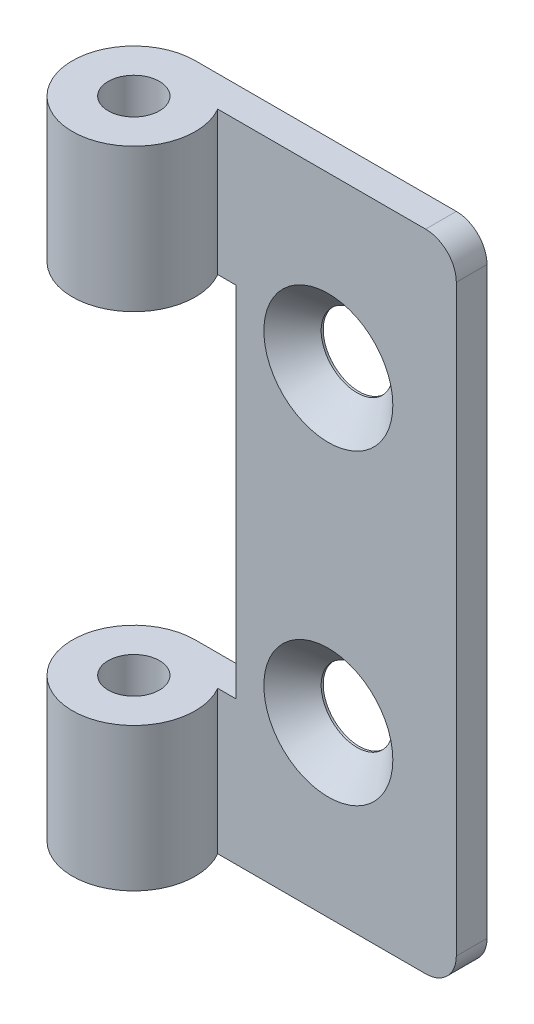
ISO-10303-21;
HEADER;
FILE_DESCRIPTION(('STEP AP214'),'2;1');
FILE_NAME('part.step','',(''),(''),'','','');
FILE_SCHEMA(('AUTOMOTIVE_DESIGN { 1 0 10303 214 1 1 1 1 }'));
ENDSEC;
DATA;
#1=APPLICATION_CONTEXT('core data for automotive mechanical design processes');
#2=APPLICATION_PROTOCOL_DEFINITION('international standard','automotive_design',2000,#1);
#3=PRODUCT_CONTEXT('',#1,'mechanical');
#4=PRODUCT('Part','Part','',(#3));
#5=PRODUCT_RELATED_PRODUCT_CATEGORY('part','',(#4));
#6=PRODUCT_DEFINITION_FORMATION('','',#4);
#7=PRODUCT_DEFINITION_CONTEXT('part definition',#1,'design');
#8=PRODUCT_DEFINITION('design','',#6,#7);
#9=PRODUCT_DEFINITION_SHAPE('','',#8);
#10=(LENGTH_UNIT() NAMED_UNIT(*) SI_UNIT(.MILLI.,.METRE.));
#11=(NAMED_UNIT(*) PLANE_ANGLE_UNIT() SI_UNIT($,.RADIAN.));
#12=(NAMED_UNIT(*) SI_UNIT($,.STERADIAN.) SOLID_ANGLE_UNIT());
#13=UNCERTAINTY_MEASURE_WITH_UNIT(LENGTH_MEASURE(1.E-05),#10,'distance_accuracy_value','');
#14=(GEOMETRIC_REPRESENTATION_CONTEXT(3) GLOBAL_UNCERTAINTY_ASSIGNED_CONTEXT((#13)) GLOBAL_UNIT_ASSIGNED_CONTEXT((#10,
#11,#12)) REPRESENTATION_CONTEXT('',''));
#15=CARTESIAN_POINT('',(0.,0.,0.));
#16=DIRECTION('',(0.,0.,1.));
#17=DIRECTION('',(1.,0.,0.));
#18=AXIS2_PLACEMENT_3D('',#15,#16,#17);
#19=CARTESIAN_POINT('',(0.,31.5,0.));
#20=DIRECTION('',(0.,-1.,0.));
#21=DIRECTION('',(0.,0.,-1.));
#22=AXIS2_PLACEMENT_3D('',#19,#20,#21);
#23=CYLINDRICAL_SURFACE('',#22,6.);
#24=CARTESIAN_POINT('',(0.,17.5,0.));
#25=DIRECTION('',(0.,1.,0.));
#26=DIRECTION('',(-1.,0.,0.));
#27=AXIS2_PLACEMENT_3D('',#24,#25,#26);
#28=CIRCLE('',#27,6.);
#29=CARTESIAN_POINT('',(0.,17.5,-6.));
#30=VERTEX_POINT('',#29);
#31=CARTESIAN_POINT('',(5.19615242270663,17.5,-3.));
#32=VERTEX_POINT('',#31);
#33=EDGE_CURVE('E134',#30,#32,#28,.T.);
#34=ORIENTED_EDGE('',*,*,#33,.T.);
#35=DIRECTION('',(0.,-1.,0.));
#36=VECTOR('',#35,1.);
#37=CARTESIAN_POINT('',(5.19615242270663,31.5,-3.));
#38=LINE('',#37,#36);
#39=CARTESIAN_POINT('',(5.19615242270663,31.5,-3.));
#40=VERTEX_POINT('',#39);
#41=EDGE_CURVE('E139',#40,#32,#38,.T.);
#42=ORIENTED_EDGE('',*,*,#41,.F.);
#43=CARTESIAN_POINT('',(0.,31.5,0.));
#44=DIRECTION('',(0.,1.,0.));
#45=DIRECTION('',(0.,0.,1.));
#46=AXIS2_PLACEMENT_3D('',#43,#44,#45);
#47=CIRCLE('',#46,6.);
#48=CARTESIAN_POINT('',(0.,31.5,-6.));
#49=VERTEX_POINT('',#48);
#50=EDGE_CURVE('E164',#49,#40,#47,.T.);
#51=ORIENTED_EDGE('',*,*,#50,.F.);
#52=DIRECTION('',(0.,-1.,0.));
#53=VECTOR('',#52,1.);
#54=CARTESIAN_POINT('',(0.,31.5,-6.));
#55=LINE('',#54,#53);
#56=EDGE_CURVE('E178',#49,#30,#55,.T.);
#57=ORIENTED_EDGE('',*,*,#56,.T.);
#58=EDGE_LOOP('',(#34,#42,#51,#57));
#59=FACE_BOUND('',#58,.T.);
#60=ADVANCED_FACE('F35',(#59),#23,.T.);
#61=CARTESIAN_POINT('',(0.,-17.5,0.));
#62=DIRECTION('',(0.,-1.,0.));
#63=DIRECTION('',(1.,0.,0.));
#64=AXIS2_PLACEMENT_3D('',#61,#62,#63);
#65=CIRCLE('',#64,6.);
#66=CARTESIAN_POINT('',(5.19615242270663,-17.5,-3.));
#67=VERTEX_POINT('',#66);
#68=CARTESIAN_POINT('',(0.,-17.5,-6.));
#69=VERTEX_POINT('',#68);
#70=EDGE_CURVE('E161',#67,#69,#65,.T.);
#71=ORIENTED_EDGE('',*,*,#70,.T.);
#72=CARTESIAN_POINT('',(0.,-31.5,-6.));
#73=VERTEX_POINT('',#72);
#74=EDGE_CURVE('E172',#69,#73,#55,.T.);
#75=ORIENTED_EDGE('',*,*,#74,.T.);
#76=CARTESIAN_POINT('',(0.,-31.5,0.));
#77=DIRECTION('',(0.,1.,0.));
#78=DIRECTION('',(0.,0.,1.));
#79=AXIS2_PLACEMENT_3D('',#76,#77,#78);
#80=CIRCLE('',#79,6.);
#81=CARTESIAN_POINT('',(5.19615242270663,-31.5,-3.));
#82=VERTEX_POINT('',#81);
#83=EDGE_CURVE('E163',#73,#82,#80,.T.);
#84=ORIENTED_EDGE('',*,*,#83,.T.);
#85=EDGE_CURVE('E185',#67,#82,#38,.T.);
#86=ORIENTED_EDGE('',*,*,#85,.F.);
#87=EDGE_LOOP('',(#71,#75,#84,#86));
#88=FACE_BOUND('',#87,.T.);
#89=ADVANCED_FACE('F212',(#88),#23,.T.);
#90=CARTESIAN_POINT('',(5.19615242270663,31.5,-3.));
#91=DIRECTION('',(0.,0.,-1.));
#92=DIRECTION('',(-1.,0.,0.));
#93=AXIS2_PLACEMENT_3D('',#90,#91,#92);
#94=PLANE('',#93);
#95=CARTESIAN_POINT('',(16.,15.,-3.));
#96=DIRECTION('',(0.,0.,1.));
#97=DIRECTION('',(1.,0.,0.));
#98=AXIS2_PLACEMENT_3D('',#95,#96,#97);
#99=CIRCLE('',#98,6.3);
#100=CARTESIAN_POINT('',(22.3,15.,-3.));
#101=VERTEX_POINT('',#100);
#102=EDGE_CURVE('E286',#101,#101,#99,.T.);
#103=ORIENTED_EDGE('',*,*,#102,.F.);
#104=EDGE_LOOP('',(#103));
#105=FACE_BOUND('',#104,.T.);
#106=CARTESIAN_POINT('',(16.,-15.,-3.));
#107=DIRECTION('',(0.,0.,1.));
#108=DIRECTION('',(1.,0.,0.));
#109=AXIS2_PLACEMENT_3D('',#106,#107,#108);
#110=CIRCLE('',#109,6.3);
#111=CARTESIAN_POINT('',(22.3,-15.,-3.));
#112=VERTEX_POINT('',#111);
#113=EDGE_CURVE('E301',#112,#112,#110,.T.);
#114=ORIENTED_EDGE('',*,*,#113,.F.);
#115=EDGE_LOOP('',(#114));
#116=FACE_BOUND('',#115,.T.);
#117=DIRECTION('',(1.,0.,0.));
#118=VECTOR('',#117,1.);
#119=CARTESIAN_POINT('',(5.19615242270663,-31.5,-3.));
#120=LINE('',#119,#118);
#121=CARTESIAN_POINT('',(25.5,-31.5,-3.));
#122=VERTEX_POINT('',#121);
#123=EDGE_CURVE('E175',#82,#122,#120,.T.);
#124=ORIENTED_EDGE('',*,*,#123,.T.);
#125=CARTESIAN_POINT('',(25.5,-28.5,-3.));
#126=DIRECTION('',(0.,0.,-1.));
#127=DIRECTION('',(-1.,0.,0.));
#128=AXIS2_PLACEMENT_3D('',#125,#126,#127);
#129=CIRCLE('',#128,3.);
#130=CARTESIAN_POINT('',(28.5,-28.5,-3.));
#131=VERTEX_POINT('',#130);
#132=EDGE_CURVE('E44',#122,#131,#129,.F.);
#133=ORIENTED_EDGE('',*,*,#132,.T.);
#134=DIRECTION('',(0.,-1.,0.));
#135=VECTOR('',#134,1.);
#136=CARTESIAN_POINT('',(28.5,31.5,-3.));
#137=LINE('',#136,#135);
#138=CARTESIAN_POINT('',(28.5,28.5,-3.));
#139=VERTEX_POINT('',#138);
#140=EDGE_CURVE('E182',#139,#131,#137,.T.);
#141=ORIENTED_EDGE('',*,*,#140,.F.);
#142=CARTESIAN_POINT('',(25.5,28.5,-3.));
#143=DIRECTION('',(0.,0.,-1.));
#144=DIRECTION('',(-1.,0.,0.));
#145=AXIS2_PLACEMENT_3D('',#142,#143,#144);
#146=CIRCLE('',#145,3.);
#147=CARTESIAN_POINT('',(25.5,31.5,-3.));
#148=VERTEX_POINT('',#147);
#149=EDGE_CURVE('E51',#139,#148,#146,.F.);
#150=ORIENTED_EDGE('',*,*,#149,.T.);
#151=DIRECTION('',(1.,0.,0.));
#152=VECTOR('',#151,1.);
#153=CARTESIAN_POINT('',(5.19615242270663,31.5,-3.));
#154=LINE('',#153,#152);
#155=EDGE_CURVE('E167',#40,#148,#154,.T.);
#156=ORIENTED_EDGE('',*,*,#155,.F.);
#157=ORIENTED_EDGE('',*,*,#41,.T.);
#158=DIRECTION('',(1.,0.,0.));
#159=VECTOR('',#158,1.);
#160=CARTESIAN_POINT('',(5.19615242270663,17.5,-3.));
#161=LINE('',#160,#159);
#162=CARTESIAN_POINT('',(7.,17.5,-3.));
#163=VERTEX_POINT('',#162);
#164=EDGE_CURVE('E153',#32,#163,#161,.T.);
#165=ORIENTED_EDGE('',*,*,#164,.T.);
#166=DIRECTION('',(0.,-1.,0.));
#167=VECTOR('',#166,1.);
#168=CARTESIAN_POINT('',(7.,31.5,-3.));
#169=LINE('',#168,#167);
#170=CARTESIAN_POINT('',(7.,-17.5,-3.));
#171=VERTEX_POINT('',#170);
#172=EDGE_CURVE('E124',#163,#171,#169,.T.);
#173=ORIENTED_EDGE('',*,*,#172,.T.);
#174=DIRECTION('',(-1.,0.,0.));
#175=VECTOR('',#174,1.);
#176=CARTESIAN_POINT('',(5.19615242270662,-17.5,-3.));
#177=LINE('',#176,#175);
#178=EDGE_CURVE('E158',#171,#67,#177,.T.);
#179=ORIENTED_EDGE('',*,*,#178,.T.);
#180=ORIENTED_EDGE('',*,*,#85,.T.);
#181=EDGE_LOOP('',(#124,#133,#141,#150,#156,#157,#165,#173,#179,#180));
#182=FACE_BOUND('',#181,.T.);
#183=ADVANCED_FACE('F199',(#105,#116,#182),#94,.F.);
#184=CARTESIAN_POINT('',(28.5,31.5,-6.));
#185=DIRECTION('',(-1.,0.,0.));
#186=DIRECTION('',(0.,0.,1.));
#187=AXIS2_PLACEMENT_3D('',#184,#185,#186);
#188=PLANE('',#187);
#189=ORIENTED_EDGE('',*,*,#140,.T.);
#190=DIRECTION('',(0.,0.,-1.));
#191=VECTOR('',#190,1.);
#192=CARTESIAN_POINT('',(28.5,-28.5,-6.));
#193=LINE('',#192,#191);
#194=CARTESIAN_POINT('',(28.5,-28.5,-6.));
#195=VERTEX_POINT('',#194);
#196=EDGE_CURVE('E189',#131,#195,#193,.T.);
#197=ORIENTED_EDGE('',*,*,#196,.T.);
#198=DIRECTION('',(0.,-1.,0.));
#199=VECTOR('',#198,1.);
#200=CARTESIAN_POINT('',(28.5,31.5,-6.));
#201=LINE('',#200,#199);
#202=CARTESIAN_POINT('',(28.5,28.5,-6.));
#203=VERTEX_POINT('',#202);
#204=EDGE_CURVE('E180',#203,#195,#201,.T.);
#205=ORIENTED_EDGE('',*,*,#204,.F.);
#206=DIRECTION('',(0.,0.,-1.));
#207=VECTOR('',#206,1.);
#208=CARTESIAN_POINT('',(28.5,28.5,-3.));
#209=LINE('',#208,#207);
#210=EDGE_CURVE('E138',#203,#139,#209,.F.);
#211=ORIENTED_EDGE('',*,*,#210,.T.);
#212=EDGE_LOOP('',(#189,#197,#205,#211));
#213=FACE_BOUND('',#212,.T.);
#214=ADVANCED_FACE('F203',(#213),#188,.F.);
#215=CARTESIAN_POINT('',(0.,31.5,-6.));
#216=DIRECTION('',(0.,0.,1.));
#217=DIRECTION('',(1.,0.,0.));
#218=AXIS2_PLACEMENT_3D('',#215,#216,#217);
#219=PLANE('',#218);
#220=CARTESIAN_POINT('',(16.,15.,-6.));
#221=DIRECTION('',(0.,0.,1.));
#222=DIRECTION('',(1.,0.,0.));
#223=AXIS2_PLACEMENT_3D('',#220,#221,#222);
#224=CIRCLE('',#223,3.5);
#225=CARTESIAN_POINT('',(19.5,15.,-6.));
#226=VERTEX_POINT('',#225);
#227=EDGE_CURVE('E298',#226,#226,#224,.T.);
#228=ORIENTED_EDGE('',*,*,#227,.T.);
#229=EDGE_LOOP('',(#228));
#230=FACE_BOUND('',#229,.T.);
#231=CARTESIAN_POINT('',(16.,-15.,-6.));
#232=DIRECTION('',(0.,0.,1.));
#233=DIRECTION('',(1.,0.,0.));
#234=AXIS2_PLACEMENT_3D('',#231,#232,#233);
#235=CIRCLE('',#234,3.5);
#236=CARTESIAN_POINT('',(19.5,-15.,-6.));
#237=VERTEX_POINT('',#236);
#238=EDGE_CURVE('E145',#237,#237,#235,.T.);
#239=ORIENTED_EDGE('',*,*,#238,.T.);
#240=EDGE_LOOP('',(#239));
#241=FACE_BOUND('',#240,.T.);
#242=ORIENTED_EDGE('',*,*,#204,.T.);
#243=CARTESIAN_POINT('',(25.5,-28.5,-6.));
#244=DIRECTION('',(0.,0.,1.));
#245=DIRECTION('',(1.,0.,0.));
#246=AXIS2_PLACEMENT_3D('',#243,#244,#245);
#247=CIRCLE('',#246,3.);
#248=CARTESIAN_POINT('',(25.5,-31.5,-6.));
#249=VERTEX_POINT('',#248);
#250=EDGE_CURVE('E194',#195,#249,#247,.F.);
#251=ORIENTED_EDGE('',*,*,#250,.T.);
#252=DIRECTION('',(-1.,0.,0.));
#253=VECTOR('',#252,1.);
#254=CARTESIAN_POINT('',(0.,-31.5,-6.));
#255=LINE('',#254,#253);
#256=EDGE_CURVE('E168',#249,#73,#255,.T.);
#257=ORIENTED_EDGE('',*,*,#256,.T.);
#258=ORIENTED_EDGE('',*,*,#74,.F.);
#259=DIRECTION('',(-1.,0.,0.));
#260=VECTOR('',#259,1.);
#261=CARTESIAN_POINT('',(-11.0013384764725,-17.5,-6.));
#262=LINE('',#261,#260);
#263=CARTESIAN_POINT('',(7.,-17.5,-6.));
#264=VERTEX_POINT('',#263);
#265=EDGE_CURVE('E129',#264,#69,#262,.T.);
#266=ORIENTED_EDGE('',*,*,#265,.F.);
#267=DIRECTION('',(0.,-1.,0.));
#268=VECTOR('',#267,1.);
#269=CARTESIAN_POINT('',(7.,17.5,-6.));
#270=LINE('',#269,#268);
#271=CARTESIAN_POINT('',(7.,17.5,-6.));
#272=VERTEX_POINT('',#271);
#273=EDGE_CURVE('E121',#272,#264,#270,.T.);
#274=ORIENTED_EDGE('',*,*,#273,.F.);
#275=DIRECTION('',(-1.,0.,0.));
#276=VECTOR('',#275,1.);
#277=CARTESIAN_POINT('',(0.,17.5,-6.));
#278=LINE('',#277,#276);
#279=EDGE_CURVE('E132',#272,#30,#278,.T.);
#280=ORIENTED_EDGE('',*,*,#279,.T.);
#281=ORIENTED_EDGE('',*,*,#56,.F.);
#282=DIRECTION('',(-1.,0.,0.));
#283=VECTOR('',#282,1.);
#284=CARTESIAN_POINT('',(0.,31.5,-6.));
#285=LINE('',#284,#283);
#286=CARTESIAN_POINT('',(25.5,31.5,-6.));
#287=VERTEX_POINT('',#286);
#288=EDGE_CURVE('E170',#287,#49,#285,.T.);
#289=ORIENTED_EDGE('',*,*,#288,.F.);
#290=CARTESIAN_POINT('',(25.5,28.5,-6.));
#291=DIRECTION('',(0.,0.,1.));
#292=DIRECTION('',(1.,0.,0.));
#293=AXIS2_PLACEMENT_3D('',#290,#291,#292);
#294=CIRCLE('',#293,3.);
#295=EDGE_CURVE('E192',#287,#203,#294,.F.);
#296=ORIENTED_EDGE('',*,*,#295,.T.);
#297=EDGE_LOOP('',(#242,#251,#257,#258,#266,#274,#280,#281,#289,#296));
#298=FACE_BOUND('',#297,.T.);
#299=ADVANCED_FACE('F142',(#230,#241,#298),#219,.F.);
#300=CARTESIAN_POINT('',(0.,31.5,0.));
#301=DIRECTION('',(0.,1.,0.));
#302=DIRECTION('',(0.,0.,1.));
#303=AXIS2_PLACEMENT_3D('',#300,#301,#302);
#304=PLANE('',#303);
#305=CARTESIAN_POINT('',(0.,31.5,0.));
#306=DIRECTION('',(0.,1.,0.));
#307=DIRECTION('',(0.,0.,1.));
#308=AXIS2_PLACEMENT_3D('',#305,#306,#307);
#309=CIRCLE('',#308,2.5);
#310=CARTESIAN_POINT('',(0.,31.5,2.5));
#311=VERTEX_POINT('',#310);
#312=EDGE_CURVE('E293',#311,#311,#309,.T.);
#313=ORIENTED_EDGE('',*,*,#312,.F.);
#314=EDGE_LOOP('',(#313));
#315=FACE_BOUND('',#314,.T.);
#316=ORIENTED_EDGE('',*,*,#155,.T.);
#317=DIRECTION('',(0.,0.,-1.));
#318=VECTOR('',#317,1.);
#319=CARTESIAN_POINT('',(25.5,31.5,-6.));
#320=LINE('',#319,#318);
#321=EDGE_CURVE('E11',#148,#287,#320,.T.);
#322=ORIENTED_EDGE('',*,*,#321,.T.);
#323=ORIENTED_EDGE('',*,*,#288,.T.);
#324=ORIENTED_EDGE('',*,*,#50,.T.);
#325=EDGE_LOOP('',(#316,#322,#323,#324));
#326=FACE_BOUND('',#325,.T.);
#327=ADVANCED_FACE('F220',(#315,#326),#304,.T.);
#328=CARTESIAN_POINT('',(0.,-31.5,0.));
#329=DIRECTION('',(0.,1.,0.));
#330=DIRECTION('',(0.,0.,1.));
#331=AXIS2_PLACEMENT_3D('',#328,#329,#330);
#332=PLANE('',#331);
#333=CARTESIAN_POINT('',(0.,-31.5,0.));
#334=DIRECTION('',(0.,1.,0.));
#335=DIRECTION('',(0.,0.,1.));
#336=AXIS2_PLACEMENT_3D('',#333,#334,#335);
#337=CIRCLE('',#336,2.5);
#338=CARTESIAN_POINT('',(0.,-31.5,2.5));
#339=VERTEX_POINT('',#338);
#340=EDGE_CURVE('E282',#339,#339,#337,.T.);
#341=ORIENTED_EDGE('',*,*,#340,.T.);
#342=EDGE_LOOP('',(#341));
#343=FACE_BOUND('',#342,.T.);
#344=ORIENTED_EDGE('',*,*,#256,.F.);
#345=DIRECTION('',(0.,0.,-1.));
#346=VECTOR('',#345,1.);
#347=CARTESIAN_POINT('',(25.5,-31.5,0.));
#348=LINE('',#347,#346);
#349=EDGE_CURVE('E59',#249,#122,#348,.F.);
#350=ORIENTED_EDGE('',*,*,#349,.T.);
#351=ORIENTED_EDGE('',*,*,#123,.F.);
#352=ORIENTED_EDGE('',*,*,#83,.F.);
#353=EDGE_LOOP('',(#344,#350,#351,#352));
#354=FACE_BOUND('',#353,.T.);
#355=ADVANCED_FACE('F209',(#343,#354),#332,.F.);
#356=CARTESIAN_POINT('',(-11.0013384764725,-17.5,6.));
#357=DIRECTION('',(0.,-1.,0.));
#358=DIRECTION('',(1.,0.,0.));
#359=AXIS2_PLACEMENT_3D('',#356,#357,#358);
#360=PLANE('',#359);
#361=CARTESIAN_POINT('',(0.,-17.5,0.));
#362=DIRECTION('',(0.,-1.,0.));
#363=DIRECTION('',(1.,0.,0.));
#364=AXIS2_PLACEMENT_3D('',#361,#362,#363);
#365=CIRCLE('',#364,2.5);
#366=CARTESIAN_POINT('',(2.5,-17.5,0.));
#367=VERTEX_POINT('',#366);
#368=EDGE_CURVE('E285',#367,#367,#365,.T.);
#369=ORIENTED_EDGE('',*,*,#368,.T.);
#370=EDGE_LOOP('',(#369));
#371=FACE_BOUND('',#370,.T.);
#372=ORIENTED_EDGE('',*,*,#70,.F.);
#373=ORIENTED_EDGE('',*,*,#178,.F.);
#374=DIRECTION('',(0.,0.,-1.));
#375=VECTOR('',#374,1.);
#376=CARTESIAN_POINT('',(7.,-17.5,6.));
#377=LINE('',#376,#375);
#378=EDGE_CURVE('E128',#171,#264,#377,.T.);
#379=ORIENTED_EDGE('',*,*,#378,.T.);
#380=ORIENTED_EDGE('',*,*,#265,.T.);
#381=EDGE_LOOP('',(#372,#373,#379,#380));
#382=FACE_BOUND('',#381,.T.);
#383=ADVANCED_FACE('F214',(#371,#382),#360,.F.);
#384=CARTESIAN_POINT('',(7.,17.5,6.));
#385=DIRECTION('',(1.,0.,0.));
#386=DIRECTION('',(0.,1.,0.));
#387=AXIS2_PLACEMENT_3D('',#384,#385,#386);
#388=PLANE('',#387);
#389=DIRECTION('',(0.,0.,-1.));
#390=VECTOR('',#389,1.);
#391=CARTESIAN_POINT('',(7.,17.5,6.));
#392=LINE('',#391,#390);
#393=EDGE_CURVE('E116',#163,#272,#392,.T.);
#394=ORIENTED_EDGE('',*,*,#393,.T.);
#395=ORIENTED_EDGE('',*,*,#273,.T.);
#396=ORIENTED_EDGE('',*,*,#378,.F.);
#397=ORIENTED_EDGE('',*,*,#172,.F.);
#398=EDGE_LOOP('',(#394,#395,#396,#397));
#399=FACE_BOUND('',#398,.T.);
#400=ADVANCED_FACE('F118',(#399),#388,.F.);
#401=CARTESIAN_POINT('',(-11.0013384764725,17.5,6.));
#402=DIRECTION('',(0.,1.,0.));
#403=DIRECTION('',(-1.,0.,0.));
#404=AXIS2_PLACEMENT_3D('',#401,#402,#403);
#405=PLANE('',#404);
#406=CARTESIAN_POINT('',(0.,17.5,0.));
#407=DIRECTION('',(0.,1.,0.));
#408=DIRECTION('',(-1.,0.,0.));
#409=AXIS2_PLACEMENT_3D('',#406,#407,#408);
#410=CIRCLE('',#409,2.5);
#411=CARTESIAN_POINT('',(-2.5,17.5,0.));
#412=VERTEX_POINT('',#411);
#413=EDGE_CURVE('E39',#412,#412,#410,.T.);
#414=ORIENTED_EDGE('',*,*,#413,.T.);
#415=EDGE_LOOP('',(#414));
#416=FACE_BOUND('',#415,.T.);
#417=ORIENTED_EDGE('',*,*,#279,.F.);
#418=ORIENTED_EDGE('',*,*,#393,.F.);
#419=ORIENTED_EDGE('',*,*,#164,.F.);
#420=ORIENTED_EDGE('',*,*,#33,.F.);
#421=EDGE_LOOP('',(#417,#418,#419,#420));
#422=FACE_BOUND('',#421,.T.);
#423=ADVANCED_FACE('F133',(#416,#422),#405,.F.);
#424=CARTESIAN_POINT('',(25.5,-28.5,-6.));
#425=DIRECTION('',(0.,0.,-1.));
#426=DIRECTION('',(-1.,0.,0.));
#427=AXIS2_PLACEMENT_3D('',#424,#425,#426);
#428=CYLINDRICAL_SURFACE('',#427,3.);
#429=ORIENTED_EDGE('',*,*,#132,.F.);
#430=ORIENTED_EDGE('',*,*,#349,.F.);
#431=ORIENTED_EDGE('',*,*,#250,.F.);
#432=ORIENTED_EDGE('',*,*,#196,.F.);
#433=EDGE_LOOP('',(#429,#430,#431,#432));
#434=FACE_BOUND('',#433,.T.);
#435=ADVANCED_FACE('F206',(#434),#428,.T.);
#436=CARTESIAN_POINT('',(25.5,28.5,0.));
#437=DIRECTION('',(0.,0.,1.));
#438=DIRECTION('',(1.,0.,0.));
#439=AXIS2_PLACEMENT_3D('',#436,#437,#438);
#440=CYLINDRICAL_SURFACE('',#439,3.);
#441=ORIENTED_EDGE('',*,*,#149,.F.);
#442=ORIENTED_EDGE('',*,*,#210,.F.);
#443=ORIENTED_EDGE('',*,*,#295,.F.);
#444=ORIENTED_EDGE('',*,*,#321,.F.);
#445=EDGE_LOOP('',(#441,#442,#443,#444));
#446=FACE_BOUND('',#445,.T.);
#447=ADVANCED_FACE('F37',(#446),#440,.T.);
#448=CARTESIAN_POINT('',(16.,-15.,-3.));
#449=DIRECTION('',(0.,0.,1.));
#450=DIRECTION('',(1.,0.,0.));
#451=AXIS2_PLACEMENT_3D('',#448,#449,#450);
#452=CYLINDRICAL_SURFACE('',#451,3.5);
#453=ORIENTED_EDGE('',*,*,#238,.F.);
#454=EDGE_LOOP('',(#453));
#455=FACE_BOUND('',#454,.T.);
#456=CARTESIAN_POINT('',(16.,-15.,-5.8));
#457=DIRECTION('',(0.,0.,1.));
#458=DIRECTION('',(1.,0.,0.));
#459=AXIS2_PLACEMENT_3D('',#456,#457,#458);
#460=CIRCLE('',#459,3.5);
#461=CARTESIAN_POINT('',(19.5,-15.,-5.8));
#462=VERTEX_POINT('',#461);
#463=EDGE_CURVE('E149',#462,#462,#460,.T.);
#464=ORIENTED_EDGE('',*,*,#463,.T.);
#465=EDGE_LOOP('',(#464));
#466=FACE_BOUND('',#465,.T.);
#467=ADVANCED_FACE('F224',(#455,#466),#452,.F.);
#468=CARTESIAN_POINT('',(16.,-15.,-3.));
#469=DIRECTION('',(0.,0.,1.));
#470=DIRECTION('',(1.,0.,0.));
#471=AXIS2_PLACEMENT_3D('',#468,#469,#470);
#472=CONICAL_SURFACE('',#471,6.3,0.785398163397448);
#473=ORIENTED_EDGE('',*,*,#463,.F.);
#474=EDGE_LOOP('',(#473));
#475=FACE_BOUND('',#474,.T.);
#476=ORIENTED_EDGE('',*,*,#113,.T.);
#477=EDGE_LOOP('',(#476));
#478=FACE_BOUND('',#477,.T.);
#479=ADVANCED_FACE('F229',(#475,#478),#472,.F.);
#480=CARTESIAN_POINT('',(16.,15.,-3.));
#481=DIRECTION('',(0.,0.,1.));
#482=DIRECTION('',(1.,0.,0.));
#483=AXIS2_PLACEMENT_3D('',#480,#481,#482);
#484=CYLINDRICAL_SURFACE('',#483,3.5);
#485=ORIENTED_EDGE('',*,*,#227,.F.);
#486=EDGE_LOOP('',(#485));
#487=FACE_BOUND('',#486,.T.);
#488=CARTESIAN_POINT('',(16.,15.,-5.8));
#489=DIRECTION('',(0.,0.,1.));
#490=DIRECTION('',(1.,0.,0.));
#491=AXIS2_PLACEMENT_3D('',#488,#489,#490);
#492=CIRCLE('',#491,3.5);
#493=CARTESIAN_POINT('',(19.5,15.,-5.8));
#494=VERTEX_POINT('',#493);
#495=EDGE_CURVE('E289',#494,#494,#492,.T.);
#496=ORIENTED_EDGE('',*,*,#495,.T.);
#497=EDGE_LOOP('',(#496));
#498=FACE_BOUND('',#497,.T.);
#499=ADVANCED_FACE('F262',(#487,#498),#484,.F.);
#500=CARTESIAN_POINT('',(16.,15.,-3.));
#501=DIRECTION('',(0.,0.,1.));
#502=DIRECTION('',(1.,0.,0.));
#503=AXIS2_PLACEMENT_3D('',#500,#501,#502);
#504=CONICAL_SURFACE('',#503,6.3,0.785398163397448);
#505=ORIENTED_EDGE('',*,*,#495,.F.);
#506=EDGE_LOOP('',(#505));
#507=FACE_BOUND('',#506,.T.);
#508=ORIENTED_EDGE('',*,*,#102,.T.);
#509=EDGE_LOOP('',(#508));
#510=FACE_BOUND('',#509,.T.);
#511=ADVANCED_FACE('F266',(#507,#510),#504,.F.);
#512=CARTESIAN_POINT('',(0.,-31.5,0.));
#513=DIRECTION('',(0.,1.,0.));
#514=DIRECTION('',(0.,0.,1.));
#515=AXIS2_PLACEMENT_3D('',#512,#513,#514);
#516=CYLINDRICAL_SURFACE('',#515,2.5);
#517=ORIENTED_EDGE('',*,*,#312,.T.);
#518=EDGE_LOOP('',(#517));
#519=FACE_BOUND('',#518,.T.);
#520=ORIENTED_EDGE('',*,*,#413,.F.);
#521=EDGE_LOOP('',(#520));
#522=FACE_BOUND('',#521,.T.);
#523=ADVANCED_FACE('F270',(#519,#522),#516,.F.);
#524=ORIENTED_EDGE('',*,*,#340,.F.);
#525=EDGE_LOOP('',(#524));
#526=FACE_BOUND('',#525,.T.);
#527=ORIENTED_EDGE('',*,*,#368,.F.);
#528=EDGE_LOOP('',(#527));
#529=FACE_BOUND('',#528,.T.);
#530=ADVANCED_FACE('F272',(#526,#529),#516,.F.);
#531=CLOSED_SHELL('',(#60,#89,#183,#214,#299,#327,#355,#383,#400,#423,#435,#447,#467,#479,#499,
#511,#523,#530));
#532=MANIFOLD_SOLID_BREP('B2',#531);
#533=ADVANCED_BREP_SHAPE_REPRESENTATION('',(#18,#532),#14);
#534=SHAPE_DEFINITION_REPRESENTATION(#9,#533);
ENDSEC;
END-ISO-10303-21;
